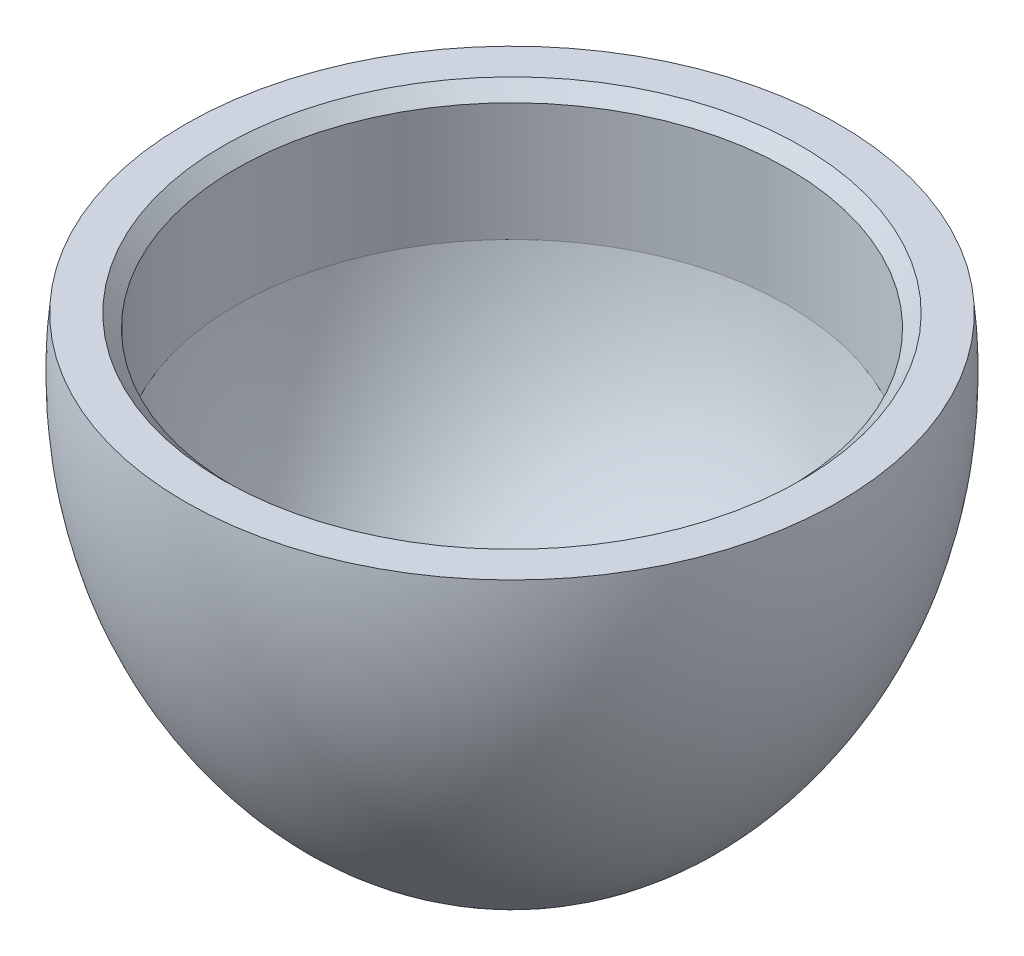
ISO-10303-21;
HEADER;
FILE_DESCRIPTION(('STEP AP214'),'2;1');
FILE_NAME('part.step','',(''),(''),'','','');
FILE_SCHEMA(('AUTOMOTIVE_DESIGN { 1 0 10303 214 1 1 1 1 }'));
ENDSEC;
DATA;
#1=APPLICATION_CONTEXT('core data for automotive mechanical design processes');
#2=APPLICATION_PROTOCOL_DEFINITION('international standard','automotive_design',2000,#1);
#3=PRODUCT_CONTEXT('',#1,'mechanical');
#4=PRODUCT('Part','Part','',(#3));
#5=PRODUCT_RELATED_PRODUCT_CATEGORY('part','',(#4));
#6=PRODUCT_DEFINITION_FORMATION('','',#4);
#7=PRODUCT_DEFINITION_CONTEXT('part definition',#1,'design');
#8=PRODUCT_DEFINITION('design','',#6,#7);
#9=PRODUCT_DEFINITION_SHAPE('','',#8);
#10=(LENGTH_UNIT() NAMED_UNIT(*) SI_UNIT(.MILLI.,.METRE.));
#11=(NAMED_UNIT(*) PLANE_ANGLE_UNIT() SI_UNIT($,.RADIAN.));
#12=(NAMED_UNIT(*) SI_UNIT($,.STERADIAN.) SOLID_ANGLE_UNIT());
#13=UNCERTAINTY_MEASURE_WITH_UNIT(LENGTH_MEASURE(1.E-05),#10,'distance_accuracy_value','');
#14=(GEOMETRIC_REPRESENTATION_CONTEXT(3) GLOBAL_UNCERTAINTY_ASSIGNED_CONTEXT((#13)) GLOBAL_UNIT_ASSIGNED_CONTEXT((#10,
#11,#12)) REPRESENTATION_CONTEXT('',''));
#15=CARTESIAN_POINT('',(0.,0.,0.));
#16=DIRECTION('',(0.,0.,1.));
#17=DIRECTION('',(1.,0.,0.));
#18=AXIS2_PLACEMENT_3D('',#15,#16,#17);
#19=CARTESIAN_POINT('',(0.,34.942963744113,-0.000217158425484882));
#20=CARTESIAN_POINT('',(-2.47002074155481,34.942963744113,-0.000217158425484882));
#21=CARTESIAN_POINT('',(-8.1811993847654,33.2171120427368,-0.000217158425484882));
#22=CARTESIAN_POINT('',(-15.9799569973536,25.0760591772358,-0.000217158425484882));
#23=CARTESIAN_POINT('',(-20.1961269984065,17.6638092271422,-0.000217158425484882));
#24=CARTESIAN_POINT('',(-26.4159810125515,-0.462030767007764,-0.000217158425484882));
#25=CARTESIAN_POINT('',(-23.3812586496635,-22.2961421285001,-0.000217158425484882));
#26=CARTESIAN_POINT('',(-9.55475702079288,-34.8978097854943,-0.000217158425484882));
#27=CARTESIAN_POINT('',(0.,-34.551436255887,-0.000217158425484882));
#28=B_SPLINE_CURVE_WITH_KNOTS('',3,(#19,#20,#21,#22,#23,#24,#25,#26,#27),.UNSPECIFIED.,.F.,.F.,
(4,1,1,1,1,1,4),(0.,0.0971267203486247,0.127738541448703,0.306118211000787,0.478065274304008,
0.702770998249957,1.),.UNSPECIFIED.);
#29=CARTESIAN_POINT('',(0.,61.3915939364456,-0.000217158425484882));
#30=DIRECTION('',(0.,1.,0.));
#31=AXIS1_PLACEMENT('',#29,#30);
#32=SURFACE_OF_REVOLUTION('',#28,#31);
#33=CARTESIAN_POINT('',(0.,-34.551436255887,-0.000217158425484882));
#34=VERTEX_POINT('',#33);
#35=VERTEX_LOOP('',#34);
#36=FACE_BOUND('',#35,.T.);
#37=CARTESIAN_POINT('',(0.,0.,-0.000217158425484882));
#38=DIRECTION('',(0.,1.,0.));
#39=DIRECTION('',(0.,0.,1.));
#40=AXIS2_PLACEMENT_3D('',#37,#38,#39);
#41=CIRCLE('',#40,24.8562743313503);
#42=CARTESIAN_POINT('',(0.,0.,24.8560571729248));
#43=VERTEX_POINT('',#42);
#44=EDGE_CURVE('E63',#43,#43,#41,.F.);
#45=ORIENTED_EDGE('',*,*,#44,.T.);
#46=EDGE_LOOP('',(#45));
#47=FACE_BOUND('',#46,.T.);
#48=ADVANCED_FACE('F37',(#36,#47),#32,.F.);
#49=CARTESIAN_POINT('',(0.,0.,0.));
#50=DIRECTION('',(0.,1.,0.));
#51=DIRECTION('',(0.,0.,1.));
#52=AXIS2_PLACEMENT_3D('',#49,#50,#51);
#53=PLANE('',#52);
#54=CARTESIAN_POINT('',(0.,0.,-0.000217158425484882));
#55=DIRECTION('',(0.,1.,0.));
#56=DIRECTION('',(0.,0.,1.));
#57=AXIS2_PLACEMENT_3D('',#54,#55,#56);
#58=CIRCLE('',#57,22.);
#59=CARTESIAN_POINT('',(0.,0.,21.9997828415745));
#60=VERTEX_POINT('',#59);
#61=EDGE_CURVE('E11',#60,#60,#58,.F.);
#62=ORIENTED_EDGE('',*,*,#61,.T.);
#63=EDGE_LOOP('',(#62));
#64=FACE_BOUND('',#63,.T.);
#65=ORIENTED_EDGE('',*,*,#44,.F.);
#66=EDGE_LOOP('',(#65));
#67=FACE_BOUND('',#66,.T.);
#68=ADVANCED_FACE('F79',(#64,#67),#53,.T.);
#69=CARTESIAN_POINT('',(0.,-69.39696961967,-0.000217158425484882));
#70=DIRECTION('',(0.,1.,0.));
#71=DIRECTION('',(0.,0.,1.));
#72=AXIS2_PLACEMENT_3D('',#69,#70,#71);
#73=CYLINDRICAL_SURFACE('',#72,21.);
#74=CARTESIAN_POINT('',(0.,-1.,-0.000217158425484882));
#75=DIRECTION('',(0.,1.,0.));
#76=DIRECTION('',(0.,0.,1.));
#77=AXIS2_PLACEMENT_3D('',#74,#75,#76);
#78=CIRCLE('',#77,21.);
#79=CARTESIAN_POINT('',(0.,-1.,20.9997828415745));
#80=VERTEX_POINT('',#79);
#81=EDGE_CURVE('E45',#80,#80,#78,.T.);
#82=ORIENTED_EDGE('',*,*,#81,.T.);
#83=EDGE_LOOP('',(#82));
#84=FACE_BOUND('',#83,.T.);
#85=CARTESIAN_POINT('',(0.,-10.,-0.000217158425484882));
#86=DIRECTION('',(0.,1.,0.));
#87=DIRECTION('',(0.,0.,1.));
#88=AXIS2_PLACEMENT_3D('',#85,#86,#87);
#89=CIRCLE('',#88,21.);
#90=CARTESIAN_POINT('',(0.,-10.,20.9997828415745));
#91=VERTEX_POINT('',#90);
#92=EDGE_CURVE('E60',#91,#91,#89,.F.);
#93=ORIENTED_EDGE('',*,*,#92,.T.);
#94=EDGE_LOOP('',(#93));
#95=FACE_BOUND('',#94,.T.);
#96=ADVANCED_FACE('F82',(#84,#95),#73,.F.);
#97=CARTESIAN_POINT('',(-21.0521470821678,-10.,0.));
#98=DIRECTION('',(0.,1.,0.));
#99=DIRECTION('',(0.,0.,1.));
#100=AXIS2_PLACEMENT_3D('',#97,#98,#99);
#101=PLANE('',#100);
#102=CARTESIAN_POINT('',(0.,-10.,0.));
#103=DIRECTION('',(0.,1.,0.));
#104=DIRECTION('',(0.,0.,1.));
#105=AXIS2_PLACEMENT_3D('',#102,#103,#104);
#106=CIRCLE('',#105,21.0521470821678);
#107=CARTESIAN_POINT('',(0.,-10.,21.0521470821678));
#108=VERTEX_POINT('',#107);
#109=EDGE_CURVE('E58',#108,#108,#106,.T.);
#110=ORIENTED_EDGE('',*,*,#109,.F.);
#111=EDGE_LOOP('',(#110));
#112=FACE_BOUND('',#111,.T.);
#113=ORIENTED_EDGE('',*,*,#92,.F.);
#114=EDGE_LOOP('',(#113));
#115=FACE_BOUND('',#114,.T.);
#116=ADVANCED_FACE('F54',(#112,#115),#101,.F.);
#117=CARTESIAN_POINT('',(-21.0521470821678,-10.,0.));
#118=CARTESIAN_POINT('',(-17.1583791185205,-28.6864247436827,0.));
#119=CARTESIAN_POINT('',(0.,-31.551436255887,0.));
#120=B_SPLINE_CURVE_WITH_KNOTS('',2,(#117,#118,#119),.UNSPECIFIED.,.F.,.F.,(3,3),(0.,1.),.UNSPECIFIED.);
#121=CARTESIAN_POINT('',(0.,0.,0.));
#122=DIRECTION('',(0.,1.,0.));
#123=AXIS1_PLACEMENT('',#121,#122);
#124=SURFACE_OF_REVOLUTION('',#120,#123);
#125=CARTESIAN_POINT('',(0.,-31.551436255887,0.));
#126=VERTEX_POINT('',#125);
#127=VERTEX_LOOP('',#126);
#128=FACE_BOUND('',#127,.T.);
#129=ORIENTED_EDGE('',*,*,#109,.T.);
#130=EDGE_LOOP('',(#129));
#131=FACE_BOUND('',#130,.T.);
#132=ADVANCED_FACE('F51',(#128,#131),#124,.T.);
#133=CARTESIAN_POINT('',(0.,-1.,-0.000217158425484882));
#134=DIRECTION('',(0.,1.,0.));
#135=DIRECTION('',(0.,0.,1.));
#136=AXIS2_PLACEMENT_3D('',#133,#134,#135);
#137=CONICAL_SURFACE('',#136,21.,0.785398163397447);
#138=ORIENTED_EDGE('',*,*,#61,.F.);
#139=EDGE_LOOP('',(#138));
#140=FACE_BOUND('',#139,.T.);
#141=ORIENTED_EDGE('',*,*,#81,.F.);
#142=EDGE_LOOP('',(#141));
#143=FACE_BOUND('',#142,.T.);
#144=ADVANCED_FACE('F39',(#140,#143),#137,.F.);
#145=CLOSED_SHELL('',(#48,#68,#96,#116,#132,#144));
#146=MANIFOLD_SOLID_BREP('B2',#145);
#147=ADVANCED_BREP_SHAPE_REPRESENTATION('',(#18,#146),#14);
#148=SHAPE_DEFINITION_REPRESENTATION(#9,#147);
ENDSEC;
END-ISO-10303-21;
